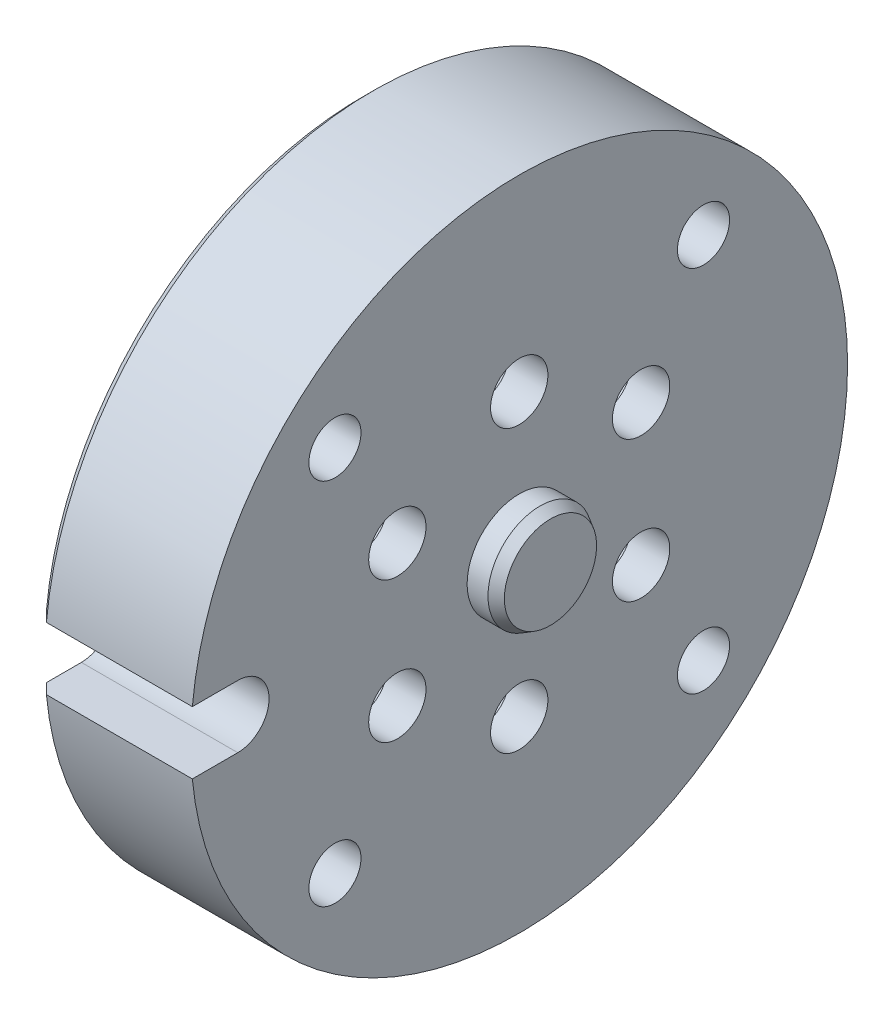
ISO-10303-21;
HEADER;
FILE_DESCRIPTION(('STEP AP214'),'2;1');
FILE_NAME('part.step','',(''),(''),'','','');
FILE_SCHEMA(('AUTOMOTIVE_DESIGN { 1 0 10303 214 1 1 1 1 }'));
ENDSEC;
DATA;
#1=APPLICATION_CONTEXT('core data for automotive mechanical design processes');
#2=APPLICATION_PROTOCOL_DEFINITION('international standard','automotive_design',2000,#1);
#3=PRODUCT_CONTEXT('',#1,'mechanical');
#4=PRODUCT('Part','Part','',(#3));
#5=PRODUCT_RELATED_PRODUCT_CATEGORY('part','',(#4));
#6=PRODUCT_DEFINITION_FORMATION('','',#4);
#7=PRODUCT_DEFINITION_CONTEXT('part definition',#1,'design');
#8=PRODUCT_DEFINITION('design','',#6,#7);
#9=PRODUCT_DEFINITION_SHAPE('','',#8);
#10=(LENGTH_UNIT() NAMED_UNIT(*) SI_UNIT(.MILLI.,.METRE.));
#11=(NAMED_UNIT(*) PLANE_ANGLE_UNIT() SI_UNIT($,.RADIAN.));
#12=(NAMED_UNIT(*) SI_UNIT($,.STERADIAN.) SOLID_ANGLE_UNIT());
#13=UNCERTAINTY_MEASURE_WITH_UNIT(LENGTH_MEASURE(1.E-05),#10,'distance_accuracy_value','');
#14=(GEOMETRIC_REPRESENTATION_CONTEXT(3) GLOBAL_UNCERTAINTY_ASSIGNED_CONTEXT((#13)) GLOBAL_UNIT_ASSIGNED_CONTEXT((#10,
#11,#12)) REPRESENTATION_CONTEXT('',''));
#15=CARTESIAN_POINT('',(0.,0.,0.));
#16=DIRECTION('',(0.,0.,1.));
#17=DIRECTION('',(1.,0.,0.));
#18=AXIS2_PLACEMENT_3D('',#15,#16,#17);
#19=CARTESIAN_POINT('',(0.,0.,0.));
#20=DIRECTION('',(-1.,0.,0.));
#21=DIRECTION('',(0.,0.,1.));
#22=AXIS2_PLACEMENT_3D('',#19,#20,#21);
#23=CYLINDRICAL_SURFACE('',#22,15.75);
#24=CARTESIAN_POINT('',(6.,0.,0.));
#25=DIRECTION('',(-1.,0.,0.));
#26=DIRECTION('',(0.,0.,1.));
#27=AXIS2_PLACEMENT_3D('',#24,#25,#26);
#28=CIRCLE('',#27,15.75);
#29=CARTESIAN_POINT('',(6.,15.0115740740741,-4.76604068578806));
#30=VERTEX_POINT('',#29);
#31=CARTESIAN_POINT('',(6.,11.6332993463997,-10.617384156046));
#32=VERTEX_POINT('',#31);
#33=EDGE_CURVE('E443',#30,#32,#28,.T.);
#34=ORIENTED_EDGE('',*,*,#33,.F.);
#35=DIRECTION('',(-1.,0.,0.));
#36=VECTOR('',#35,1.);
#37=CARTESIAN_POINT('',(5.65,15.0115740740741,-4.76604068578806));
#38=LINE('',#37,#36);
#39=CARTESIAN_POINT('',(1.,15.0115740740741,-4.76604068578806));
#40=VERTEX_POINT('',#39);
#41=EDGE_CURVE('E582',#30,#40,#38,.T.);
#42=ORIENTED_EDGE('',*,*,#41,.T.);
#43=CARTESIAN_POINT('',(1.,0.,0.));
#44=DIRECTION('',(1.,0.,0.));
#45=DIRECTION('',(0.,0.,-1.));
#46=AXIS2_PLACEMENT_3D('',#43,#44,#45);
#47=CIRCLE('',#46,15.75);
#48=CARTESIAN_POINT('',(1.,11.6332993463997,-10.617384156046));
#49=VERTEX_POINT('',#48);
#50=EDGE_CURVE('E467',#40,#49,#47,.F.);
#51=ORIENTED_EDGE('',*,*,#50,.T.);
#52=DIRECTION('',(-1.,0.,0.));
#53=VECTOR('',#52,1.);
#54=CARTESIAN_POINT('',(5.65,11.6332993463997,-10.617384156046));
#55=LINE('',#54,#53);
#56=EDGE_CURVE('E393',#49,#32,#55,.F.);
#57=ORIENTED_EDGE('',*,*,#56,.T.);
#58=EDGE_LOOP('',(#34,#42,#51,#57));
#59=FACE_BOUND('',#58,.T.);
#60=ADVANCED_FACE('F16',(#59),#23,.F.);
#61=CARTESIAN_POINT('',(0.,31.5,0.));
#62=DIRECTION('',(1.,0.,0.));
#63=DIRECTION('',(0.,0.,-1.));
#64=AXIS2_PLACEMENT_3D('',#61,#62,#63);
#65=PLANE('',#64);
#66=CARTESIAN_POINT('',(0.,0.,-25.));
#67=DIRECTION('',(-1.,0.,0.));
#68=DIRECTION('',(0.,0.,1.));
#69=AXIS2_PLACEMENT_3D('',#66,#67,#68);
#70=CIRCLE('',#69,3.);
#71=CARTESIAN_POINT('',(0.,0.,-22.));
#72=VERTEX_POINT('',#71);
#73=EDGE_CURVE('E413',#72,#72,#70,.T.);
#74=ORIENTED_EDGE('',*,*,#73,.F.);
#75=EDGE_LOOP('',(#74));
#76=FACE_BOUND('',#75,.T.);
#77=CARTESIAN_POINT('',(0.,17.6776695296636,-17.6776695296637));
#78=DIRECTION('',(-1.,0.,0.));
#79=DIRECTION('',(0.,0.,1.));
#80=AXIS2_PLACEMENT_3D('',#77,#78,#79);
#81=CIRCLE('',#80,2.5);
#82=CARTESIAN_POINT('',(0.,17.6776695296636,-15.1776695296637));
#83=VERTEX_POINT('',#82);
#84=EDGE_CURVE('E419',#83,#83,#81,.T.);
#85=ORIENTED_EDGE('',*,*,#84,.F.);
#86=EDGE_LOOP('',(#85));
#87=FACE_BOUND('',#86,.T.);
#88=CARTESIAN_POINT('',(0.,-17.6776695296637,-17.6776695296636));
#89=DIRECTION('',(-1.,0.,0.));
#90=DIRECTION('',(0.,0.,1.));
#91=AXIS2_PLACEMENT_3D('',#88,#89,#90);
#92=CIRCLE('',#91,2.5);
#93=CARTESIAN_POINT('',(0.,-17.6776695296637,-15.1776695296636));
#94=VERTEX_POINT('',#93);
#95=EDGE_CURVE('E425',#94,#94,#92,.T.);
#96=ORIENTED_EDGE('',*,*,#95,.F.);
#97=EDGE_LOOP('',(#96));
#98=FACE_BOUND('',#97,.T.);
#99=CARTESIAN_POINT('',(0.,-17.6776695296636,17.6776695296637));
#100=DIRECTION('',(-1.,0.,0.));
#101=DIRECTION('',(0.,0.,1.));
#102=AXIS2_PLACEMENT_3D('',#99,#100,#101);
#103=CIRCLE('',#102,2.5);
#104=CARTESIAN_POINT('',(0.,-17.6776695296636,20.1776695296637));
#105=VERTEX_POINT('',#104);
#106=EDGE_CURVE('E431',#105,#105,#103,.T.);
#107=ORIENTED_EDGE('',*,*,#106,.F.);
#108=EDGE_LOOP('',(#107));
#109=FACE_BOUND('',#108,.T.);
#110=CARTESIAN_POINT('',(0.,17.6776695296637,17.6776695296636));
#111=DIRECTION('',(-1.,0.,0.));
#112=DIRECTION('',(0.,0.,1.));
#113=AXIS2_PLACEMENT_3D('',#110,#111,#112);
#114=CIRCLE('',#113,2.5);
#115=CARTESIAN_POINT('',(0.,17.6776695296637,20.1776695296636));
#116=VERTEX_POINT('',#115);
#117=EDGE_CURVE('E437',#116,#116,#114,.T.);
#118=ORIENTED_EDGE('',*,*,#117,.F.);
#119=EDGE_LOOP('',(#118));
#120=FACE_BOUND('',#119,.T.);
#121=DIRECTION('',(0.,0.,-1.));
#122=VECTOR('',#121,1.);
#123=CARTESIAN_POINT('',(0.,3.,27.));
#124=LINE('',#123,#122);
#125=CARTESIAN_POINT('',(0.,3.,30.3521004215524));
#126=VERTEX_POINT('',#125);
#127=CARTESIAN_POINT('',(0.,3.,27.));
#128=VERTEX_POINT('',#127);
#129=EDGE_CURVE('E402',#126,#128,#124,.T.);
#130=ORIENTED_EDGE('',*,*,#129,.F.);
#131=CARTESIAN_POINT('',(0.,0.,0.));
#132=DIRECTION('',(1.,0.,0.));
#133=DIRECTION('',(0.,0.,-1.));
#134=AXIS2_PLACEMENT_3D('',#131,#132,#133);
#135=CIRCLE('',#134,30.5);
#136=CARTESIAN_POINT('',(0.,-3.,30.3521004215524));
#137=VERTEX_POINT('',#136);
#138=EDGE_CURVE('E188',#126,#137,#135,.F.);
#139=ORIENTED_EDGE('',*,*,#138,.T.);
#140=DIRECTION('',(0.,0.,1.));
#141=VECTOR('',#140,1.);
#142=CARTESIAN_POINT('',(0.,-3.,27.));
#143=LINE('',#142,#141);
#144=CARTESIAN_POINT('',(0.,-3.,27.));
#145=VERTEX_POINT('',#144);
#146=EDGE_CURVE('E400',#145,#137,#143,.T.);
#147=ORIENTED_EDGE('',*,*,#146,.F.);
#148=CARTESIAN_POINT('',(0.,0.,27.));
#149=DIRECTION('',(-1.,0.,0.));
#150=DIRECTION('',(0.,0.,1.));
#151=AXIS2_PLACEMENT_3D('',#148,#149,#150);
#152=CIRCLE('',#151,3.);
#153=EDGE_CURVE('E397',#128,#145,#152,.T.);
#154=ORIENTED_EDGE('',*,*,#153,.F.);
#155=EDGE_LOOP('',(#130,#139,#147,#154));
#156=FACE_BOUND('',#155,.T.);
#157=CARTESIAN_POINT('',(0.,13.5,0.));
#158=DIRECTION('',(-1.,0.,0.));
#159=DIRECTION('',(0.,0.,1.));
#160=AXIS2_PLACEMENT_3D('',#157,#158,#159);
#161=CIRCLE('',#160,5.);
#162=CARTESIAN_POINT('',(0.,16.2152777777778,4.19848384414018));
#163=VERTEX_POINT('',#162);
#164=CARTESIAN_POINT('',(0.,16.2152777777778,-4.19848384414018));
#165=VERTEX_POINT('',#164);
#166=EDGE_CURVE('E180',#163,#165,#161,.T.);
#167=ORIENTED_EDGE('',*,*,#166,.F.);
#168=CARTESIAN_POINT('',(0.,0.,0.));
#169=DIRECTION('',(1.,0.,0.));
#170=DIRECTION('',(0.,0.,-1.));
#171=AXIS2_PLACEMENT_3D('',#168,#169,#170);
#172=CIRCLE('',#171,16.75);
#173=CARTESIAN_POINT('',(0.,11.7436325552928,11.9436005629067));
#174=VERTEX_POINT('',#173);
#175=EDGE_CURVE('E195',#163,#174,#172,.T.);
#176=ORIENTED_EDGE('',*,*,#175,.T.);
#177=CARTESIAN_POINT('',(0.,6.75,11.6913429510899));
#178=DIRECTION('',(-1.,0.,0.));
#179=DIRECTION('',(0.,0.,1.));
#180=AXIS2_PLACEMENT_3D('',#177,#178,#179);
#181=CIRCLE('',#180,5.);
#182=CARTESIAN_POINT('',(0.,4.47164522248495,16.1420844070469));
#183=VERTEX_POINT('',#182);
#184=EDGE_CURVE('E264',#183,#174,#181,.T.);
#185=ORIENTED_EDGE('',*,*,#184,.F.);
#186=CARTESIAN_POINT('',(0.,-4.47164522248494,16.1420844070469));
#187=VERTEX_POINT('',#186);
#188=EDGE_CURVE('E205',#183,#187,#172,.T.);
#189=ORIENTED_EDGE('',*,*,#188,.T.);
#190=CARTESIAN_POINT('',(0.,-6.75,11.6913429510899));
#191=DIRECTION('',(-1.,0.,0.));
#192=DIRECTION('',(0.,0.,1.));
#193=AXIS2_PLACEMENT_3D('',#190,#191,#192);
#194=CIRCLE('',#193,5.);
#195=CARTESIAN_POINT('',(0.,-11.7436325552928,11.9436005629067));
#196=VERTEX_POINT('',#195);
#197=EDGE_CURVE('E306',#196,#187,#194,.T.);
#198=ORIENTED_EDGE('',*,*,#197,.F.);
#199=CARTESIAN_POINT('',(0.,-16.2152777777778,4.19848384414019));
#200=VERTEX_POINT('',#199);
#201=EDGE_CURVE('E209',#196,#200,#172,.T.);
#202=ORIENTED_EDGE('',*,*,#201,.T.);
#203=CARTESIAN_POINT('',(0.,-13.5,0.));
#204=DIRECTION('',(-1.,0.,0.));
#205=DIRECTION('',(0.,0.,1.));
#206=AXIS2_PLACEMENT_3D('',#203,#204,#205);
#207=CIRCLE('',#206,5.);
#208=CARTESIAN_POINT('',(0.,-16.2152777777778,-4.19848384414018));
#209=VERTEX_POINT('',#208);
#210=EDGE_CURVE('E340',#209,#200,#207,.T.);
#211=ORIENTED_EDGE('',*,*,#210,.F.);
#212=CARTESIAN_POINT('',(0.,-11.7436325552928,-11.9436005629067));
#213=VERTEX_POINT('',#212);
#214=EDGE_CURVE('E480',#209,#213,#172,.T.);
#215=ORIENTED_EDGE('',*,*,#214,.T.);
#216=CARTESIAN_POINT('',(0.,-6.75,-11.6913429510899));
#217=DIRECTION('',(-1.,0.,0.));
#218=DIRECTION('',(0.,0.,1.));
#219=AXIS2_PLACEMENT_3D('',#216,#217,#218);
#220=CIRCLE('',#219,5.);
#221=CARTESIAN_POINT('',(0.,-4.47164522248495,-16.1420844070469));
#222=VERTEX_POINT('',#221);
#223=EDGE_CURVE('E359',#222,#213,#220,.T.);
#224=ORIENTED_EDGE('',*,*,#223,.F.);
#225=CARTESIAN_POINT('',(0.,4.47164522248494,-16.1420844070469));
#226=VERTEX_POINT('',#225);
#227=EDGE_CURVE('E208',#222,#226,#172,.T.);
#228=ORIENTED_EDGE('',*,*,#227,.T.);
#229=CARTESIAN_POINT('',(0.,6.75,-11.6913429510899));
#230=DIRECTION('',(-1.,0.,0.));
#231=DIRECTION('',(0.,0.,1.));
#232=AXIS2_PLACEMENT_3D('',#229,#230,#231);
#233=CIRCLE('',#232,5.);
#234=CARTESIAN_POINT('',(0.,11.7436325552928,-11.9436005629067));
#235=VERTEX_POINT('',#234);
#236=EDGE_CURVE('E378',#235,#226,#233,.T.);
#237=ORIENTED_EDGE('',*,*,#236,.F.);
#238=EDGE_CURVE('E199',#235,#165,#172,.T.);
#239=ORIENTED_EDGE('',*,*,#238,.T.);
#240=EDGE_LOOP('',(#167,#176,#185,#189,#198,#202,#211,#215,#224,#228,#237,#239));
#241=FACE_BOUND('',#240,.T.);
#242=ADVANCED_FACE('F193',(#76,#87,#98,#109,#120,#156,#241),#65,.F.);
#243=CARTESIAN_POINT('',(1.,0.,0.));
#244=DIRECTION('',(-1.,0.,0.));
#245=DIRECTION('',(0.,0.,1.));
#246=AXIS2_PLACEMENT_3D('',#243,#244,#245);
#247=CONICAL_SURFACE('',#246,15.75,0.785398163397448);
#248=CARTESIAN_POINT('',(1.0002,15.0113407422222,4.76611468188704));
#249=CARTESIAN_POINT('',(0.912059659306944,15.1141669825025,4.73350697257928));
#250=CARTESIAN_POINT('',(0.824896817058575,15.216721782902,4.69732536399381));
#251=CARTESIAN_POINT('',(0.653084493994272,15.4204945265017,4.61775153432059));
#252=CARTESIAN_POINT('',(0.568427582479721,15.521715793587,4.57438383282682));
#253=CARTESIAN_POINT('',(0.401585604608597,15.7227294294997,4.48015562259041));
#254=CARTESIAN_POINT('',(0.319400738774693,15.8225216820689,4.42929450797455));
#255=CARTESIAN_POINT('',(0.157550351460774,16.0204738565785,4.31972797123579));
#256=CARTESIAN_POINT('',(0.0778942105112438,16.1186271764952,4.26099679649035));
#257=CARTESIAN_POINT('',(-0.000199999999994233,16.2155259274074,4.19832334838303));
#258=B_SPLINE_CURVE_WITH_KNOTS('',3,(#248,#249,#250,#251,#252,#253,#254,#255,#256,#257),
.UNSPECIFIED.,.F.,.F.,(4,2,2,2,4),(0.,0.417883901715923,0.834370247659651,1.25089028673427,
1.66880816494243),.UNSPECIFIED.);
#259=CARTESIAN_POINT('',(1.,15.0115740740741,4.76604068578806));
#260=VERTEX_POINT('',#259);
#261=EDGE_CURVE('E176',#260,#163,#258,.T.);
#262=ORIENTED_EDGE('',*,*,#261,.F.);
#263=CARTESIAN_POINT('',(1.,11.6332993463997,10.617384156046));
#264=VERTEX_POINT('',#263);
#265=EDGE_CURVE('E470',#264,#260,#47,.F.);
#266=ORIENTED_EDGE('',*,*,#265,.F.);
#267=CARTESIAN_POINT('',(-0.000199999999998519,11.7436176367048,11.9438957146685));
#268=CARTESIAN_POINT('',(0.0778942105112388,11.7494450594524,11.82864221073));
#269=CARTESIAN_POINT('',(0.157550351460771,11.7512310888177,11.7142733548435));
#270=CARTESIAN_POINT('',(0.319400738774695,11.7471424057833,11.4880584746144));
#271=CARTESIAN_POINT('',(0.401585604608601,11.7412932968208,11.3762052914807));
#272=CARTESIAN_POINT('',(0.56842758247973,11.7223905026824,11.1550082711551));
#273=CARTESIAN_POINT('',(0.653084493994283,11.7093374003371,11.0456642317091));
#274=CARTESIAN_POINT('',(0.824896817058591,11.6763639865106,10.8294049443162));
#275=CARTESIAN_POINT('',(0.912059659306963,11.6564207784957,10.7224990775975));
#276=CARTESIAN_POINT('',(1.00020000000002,11.6332467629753,10.6171450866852));
#277=B_SPLINE_CURVE_WITH_KNOTS('',3,(#267,#268,#269,#270,#271,#272,#273,#274,#275,#276),
.UNSPECIFIED.,.F.,.F.,(4,2,2,2,4),(0.,0.417917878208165,0.834437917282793,1.25092426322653,
1.66880816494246),.UNSPECIFIED.);
#278=EDGE_CURVE('E204',#174,#264,#277,.T.);
#279=ORIENTED_EDGE('',*,*,#278,.F.);
#280=ORIENTED_EDGE('',*,*,#175,.F.);
#281=EDGE_LOOP('',(#262,#266,#279,#280));
#282=FACE_BOUND('',#281,.T.);
#283=ADVANCED_FACE('F203',(#282),#247,.F.);
#284=ORIENTED_EDGE('',*,*,#265,.T.);
#285=DIRECTION('',(-1.,0.,0.));
#286=VECTOR('',#285,1.);
#287=CARTESIAN_POINT('',(5.65,15.0115740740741,4.76604068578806));
#288=LINE('',#287,#286);
#289=CARTESIAN_POINT('',(6.,15.0115740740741,4.76604068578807));
#290=VERTEX_POINT('',#289);
#291=EDGE_CURVE('E183',#260,#290,#288,.F.);
#292=ORIENTED_EDGE('',*,*,#291,.T.);
#293=CARTESIAN_POINT('',(6.,11.6332993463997,10.617384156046));
#294=VERTEX_POINT('',#293);
#295=EDGE_CURVE('E512',#294,#290,#28,.T.);
#296=ORIENTED_EDGE('',*,*,#295,.F.);
#297=DIRECTION('',(-1.,0.,0.));
#298=VECTOR('',#297,1.);
#299=CARTESIAN_POINT('',(5.65,11.6332993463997,10.617384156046));
#300=LINE('',#299,#298);
#301=EDGE_CURVE('E321',#294,#264,#300,.T.);
#302=ORIENTED_EDGE('',*,*,#301,.T.);
#303=EDGE_LOOP('',(#284,#292,#296,#302));
#304=FACE_BOUND('',#303,.T.);
#305=ADVANCED_FACE('F510',(#304),#23,.F.);
#306=CARTESIAN_POINT('',(1.0002,3.37809397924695,15.3832597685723));
#307=CARTESIAN_POINT('',(0.912059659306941,3.45774620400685,15.4560060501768));
#308=CARTESIAN_POINT('',(0.824896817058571,3.54035779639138,15.5267303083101));
#309=CARTESIAN_POINT('',(0.653084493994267,3.71115712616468,15.6634157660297));
#310=CARTESIAN_POINT('',(0.568427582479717,3.79932529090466,15.7293921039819));
#311=CARTESIAN_POINT('',(0.401585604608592,3.98143613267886,15.8563609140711));
#312=CARTESIAN_POINT('',(0.319400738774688,4.07537927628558,15.917352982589));
#313=CARTESIAN_POINT('',(0.157550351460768,4.26924276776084,16.0340013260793));
#314=CARTESIAN_POINT('',(0.0778942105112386,4.36918211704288,16.0896390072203));
#315=CARTESIAN_POINT('',(-0.000199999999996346,4.47190829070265,16.1422190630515));
#316=B_SPLINE_CURVE_WITH_KNOTS('',3,(#306,#307,#308,#309,#310,#311,#312,#313,#314,#315),
.UNSPECIFIED.,.F.,.F.,(4,2,2,2,4),(0.,0.417883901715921,0.834370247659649,1.25089028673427,
1.66880816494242),.UNSPECIFIED.);
#317=CARTESIAN_POINT('',(1.,3.37827472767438,15.383424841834));
#318=VERTEX_POINT('',#317);
#319=EDGE_CURVE('E300',#318,#183,#316,.T.);
#320=ORIENTED_EDGE('',*,*,#319,.F.);
#321=CARTESIAN_POINT('',(1.,-3.37827472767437,15.383424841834));
#322=VERTEX_POINT('',#321);
#323=EDGE_CURVE('E475',#322,#318,#47,.F.);
#324=ORIENTED_EDGE('',*,*,#323,.F.);
#325=CARTESIAN_POINT('',(-0.000199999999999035,-4.47190829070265,16.1422190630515));
#326=CARTESIAN_POINT('',(0.0778942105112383,-4.36918211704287,16.0896390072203));
#327=CARTESIAN_POINT('',(0.157550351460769,-4.26924276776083,16.0340013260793));
#328=CARTESIAN_POINT('',(0.319400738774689,-4.07537927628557,15.917352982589));
#329=CARTESIAN_POINT('',(0.401585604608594,-3.98143613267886,15.8563609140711));
#330=CARTESIAN_POINT('',(0.568427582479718,-3.79932529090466,15.7293921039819));
#331=CARTESIAN_POINT('',(0.653084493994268,-3.71115712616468,15.6634157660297));
#332=CARTESIAN_POINT('',(0.824896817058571,-3.54035779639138,15.5267303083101));
#333=CARTESIAN_POINT('',(0.912059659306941,-3.45774620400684,15.4560060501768));
#334=CARTESIAN_POINT('',(1.0002,-3.37809397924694,15.3832597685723));
#335=B_SPLINE_CURVE_WITH_KNOTS('',3,(#325,#326,#327,#328,#329,#330,#331,#332,#333,#334),
.UNSPECIFIED.,.F.,.F.,(4,2,2,2,4),(0.,0.417917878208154,0.834437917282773,1.2509242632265,
1.66880816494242),.UNSPECIFIED.);
#336=EDGE_CURVE('E495',#187,#322,#335,.T.);
#337=ORIENTED_EDGE('',*,*,#336,.F.);
#338=ORIENTED_EDGE('',*,*,#188,.F.);
#339=EDGE_LOOP('',(#320,#324,#337,#338));
#340=FACE_BOUND('',#339,.T.);
#341=ADVANCED_FACE('F493',(#340),#247,.F.);
#342=ORIENTED_EDGE('',*,*,#323,.T.);
#343=DIRECTION('',(-1.,0.,0.));
#344=VECTOR('',#343,1.);
#345=CARTESIAN_POINT('',(5.65,3.37827472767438,15.383424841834));
#346=LINE('',#345,#344);
#347=CARTESIAN_POINT('',(6.,3.37827472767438,15.383424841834));
#348=VERTEX_POINT('',#347);
#349=EDGE_CURVE('E307',#318,#348,#346,.F.);
#350=ORIENTED_EDGE('',*,*,#349,.T.);
#351=CARTESIAN_POINT('',(6.,-3.37827472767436,15.383424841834));
#352=VERTEX_POINT('',#351);
#353=EDGE_CURVE('E516',#352,#348,#28,.T.);
#354=ORIENTED_EDGE('',*,*,#353,.F.);
#355=DIRECTION('',(-1.,0.,0.));
#356=VECTOR('',#355,1.);
#357=CARTESIAN_POINT('',(5.65,-3.37827472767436,15.383424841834));
#358=LINE('',#357,#356);
#359=EDGE_CURVE('E330',#352,#322,#358,.T.);
#360=ORIENTED_EDGE('',*,*,#359,.T.);
#361=EDGE_LOOP('',(#342,#350,#354,#360));
#362=FACE_BOUND('',#361,.T.);
#363=ADVANCED_FACE('F489',(#362),#23,.F.);
#364=CARTESIAN_POINT('',(1.00020000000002,-11.6332467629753,10.6171450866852));
#365=CARTESIAN_POINT('',(0.912059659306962,-11.6564207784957,10.7224990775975));
#366=CARTESIAN_POINT('',(0.82489681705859,-11.6763639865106,10.8294049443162));
#367=CARTESIAN_POINT('',(0.653084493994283,-11.7093374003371,11.0456642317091));
#368=CARTESIAN_POINT('',(0.56842758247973,-11.7223905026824,11.1550082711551));
#369=CARTESIAN_POINT('',(0.401585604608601,-11.7412932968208,11.3762052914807));
#370=CARTESIAN_POINT('',(0.319400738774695,-11.7471424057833,11.4880584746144));
#371=CARTESIAN_POINT('',(0.157550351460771,-11.7512310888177,11.7142733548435));
#372=CARTESIAN_POINT('',(0.0778942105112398,-11.7494450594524,11.82864221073));
#373=CARTESIAN_POINT('',(-0.000199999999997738,-11.7436176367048,11.9438957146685));
#374=B_SPLINE_CURVE_WITH_KNOTS('',3,(#364,#365,#366,#367,#368,#369,#370,#371,#372,#373),
.UNSPECIFIED.,.F.,.F.,(4,2,2,2,4),(0.,0.41788390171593,0.834370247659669,1.2508902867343,
1.66880816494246),.UNSPECIFIED.);
#375=CARTESIAN_POINT('',(1.,-11.6332993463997,10.617384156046));
#376=VERTEX_POINT('',#375);
#377=EDGE_CURVE('E924',#376,#196,#374,.T.);
#378=ORIENTED_EDGE('',*,*,#377,.F.);
#379=CARTESIAN_POINT('',(1.,-15.0115740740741,4.76604068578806));
#380=VERTEX_POINT('',#379);
#381=EDGE_CURVE('E482',#380,#376,#47,.F.);
#382=ORIENTED_EDGE('',*,*,#381,.F.);
#383=CARTESIAN_POINT('',(-0.000199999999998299,-16.2155259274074,4.19832334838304));
#384=CARTESIAN_POINT('',(0.0778942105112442,-16.1186271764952,4.26099679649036));
#385=CARTESIAN_POINT('',(0.157550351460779,-16.0204738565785,4.3197279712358));
#386=CARTESIAN_POINT('',(0.319400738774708,-15.8225216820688,4.42929450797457));
#387=CARTESIAN_POINT('',(0.401585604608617,-15.7227294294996,4.48015562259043));
#388=CARTESIAN_POINT('',(0.568427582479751,-15.521715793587,4.57438383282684));
#389=CARTESIAN_POINT('',(0.653084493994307,-15.4204945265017,4.61775153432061));
#390=CARTESIAN_POINT('',(0.824896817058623,-15.2167217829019,4.69732536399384));
#391=CARTESIAN_POINT('',(0.912059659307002,-15.1141669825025,4.7335069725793));
#392=CARTESIAN_POINT('',(1.00020000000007,-15.0113407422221,4.76611468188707));
#393=B_SPLINE_CURVE_WITH_KNOTS('',3,(#383,#384,#385,#386,#387,#388,#389,#390,#391,#392),
.UNSPECIFIED.,.F.,.F.,(4,2,2,2,4),(0.,0.417917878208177,0.83443791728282,1.25092426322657,
1.66880816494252),.UNSPECIFIED.);
#394=EDGE_CURVE('E895',#200,#380,#393,.T.);
#395=ORIENTED_EDGE('',*,*,#394,.F.);
#396=ORIENTED_EDGE('',*,*,#201,.F.);
#397=EDGE_LOOP('',(#378,#382,#395,#396));
#398=FACE_BOUND('',#397,.T.);
#399=ADVANCED_FACE('F556',(#398),#247,.F.);
#400=ORIENTED_EDGE('',*,*,#381,.T.);
#401=DIRECTION('',(-1.,0.,0.));
#402=VECTOR('',#401,1.);
#403=CARTESIAN_POINT('',(5.65,-11.6332993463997,10.617384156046));
#404=LINE('',#403,#402);
#405=CARTESIAN_POINT('',(6.,-11.6332993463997,10.617384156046));
#406=VERTEX_POINT('',#405);
#407=EDGE_CURVE('E336',#376,#406,#404,.F.);
#408=ORIENTED_EDGE('',*,*,#407,.T.);
#409=CARTESIAN_POINT('',(6.,-15.0115740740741,4.76604068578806));
#410=VERTEX_POINT('',#409);
#411=EDGE_CURVE('E518',#410,#406,#28,.T.);
#412=ORIENTED_EDGE('',*,*,#411,.F.);
#413=DIRECTION('',(-1.,0.,0.));
#414=VECTOR('',#413,1.);
#415=CARTESIAN_POINT('',(5.65,-15.0115740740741,4.76604068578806));
#416=LINE('',#415,#414);
#417=EDGE_CURVE('E349',#410,#380,#416,.T.);
#418=ORIENTED_EDGE('',*,*,#417,.T.);
#419=EDGE_LOOP('',(#400,#408,#412,#418));
#420=FACE_BOUND('',#419,.T.);
#421=ADVANCED_FACE('F550',(#420),#23,.F.);
#422=CARTESIAN_POINT('',(1.00020000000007,-15.0113407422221,-4.76611468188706));
#423=CARTESIAN_POINT('',(0.912059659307,-15.1141669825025,-4.73350697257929));
#424=CARTESIAN_POINT('',(0.824896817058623,-15.2167217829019,-4.69732536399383));
#425=CARTESIAN_POINT('',(0.653084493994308,-15.4204945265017,-4.6177515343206));
#426=CARTESIAN_POINT('',(0.568427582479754,-15.521715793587,-4.57438383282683));
#427=CARTESIAN_POINT('',(0.40158560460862,-15.7227294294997,-4.48015562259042));
#428=CARTESIAN_POINT('',(0.31940073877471,-15.8225216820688,-4.42929450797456));
#429=CARTESIAN_POINT('',(0.157550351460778,-16.0204738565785,-4.31972797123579));
#430=CARTESIAN_POINT('',(0.0778942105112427,-16.1186271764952,-4.26099679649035));
#431=CARTESIAN_POINT('',(-0.000199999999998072,-16.2155259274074,-4.19832334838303));
#432=B_SPLINE_CURVE_WITH_KNOTS('',3,(#422,#423,#424,#425,#426,#427,#428,#429,#430,#431),
.UNSPECIFIED.,.F.,.F.,(4,2,2,2,4),(0.,0.417883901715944,0.834370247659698,1.25089028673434,
1.66880816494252),.UNSPECIFIED.);
#433=CARTESIAN_POINT('',(1.,-15.0115740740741,-4.76604068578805));
#434=VERTEX_POINT('',#433);
#435=EDGE_CURVE('E900',#434,#209,#432,.T.);
#436=ORIENTED_EDGE('',*,*,#435,.F.);
#437=CARTESIAN_POINT('',(1.,-11.6332993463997,-10.617384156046));
#438=VERTEX_POINT('',#437);
#439=EDGE_CURVE('E477',#438,#434,#47,.F.);
#440=ORIENTED_EDGE('',*,*,#439,.F.);
#441=CARTESIAN_POINT('',(-0.000199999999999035,-11.7436176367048,-11.9438957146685));
#442=CARTESIAN_POINT('',(0.0778942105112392,-11.7494450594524,-11.82864221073));
#443=CARTESIAN_POINT('',(0.157550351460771,-11.7512310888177,-11.7142733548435));
#444=CARTESIAN_POINT('',(0.319400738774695,-11.7471424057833,-11.4880584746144));
#445=CARTESIAN_POINT('',(0.401585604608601,-11.7412932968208,-11.3762052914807));
#446=CARTESIAN_POINT('',(0.56842758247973,-11.7223905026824,-11.1550082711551));
#447=CARTESIAN_POINT('',(0.653084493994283,-11.7093374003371,-11.0456642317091));
#448=CARTESIAN_POINT('',(0.824896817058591,-11.6763639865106,-10.8294049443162));
#449=CARTESIAN_POINT('',(0.912059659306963,-11.6564207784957,-10.7224990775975));
#450=CARTESIAN_POINT('',(1.00020000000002,-11.6332467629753,-10.6171450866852));
#451=B_SPLINE_CURVE_WITH_KNOTS('',3,(#441,#442,#443,#444,#445,#446,#447,#448,#449,#450),
.UNSPECIFIED.,.F.,.F.,(4,2,2,2,4),(0.,0.417917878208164,0.834437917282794,1.25092426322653,
1.66880816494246),.UNSPECIFIED.);
#452=EDGE_CURVE('E909',#213,#438,#451,.T.);
#453=ORIENTED_EDGE('',*,*,#452,.F.);
#454=ORIENTED_EDGE('',*,*,#214,.F.);
#455=EDGE_LOOP('',(#436,#440,#453,#454));
#456=FACE_BOUND('',#455,.T.);
#457=ADVANCED_FACE('F548',(#456),#247,.F.);
#458=ORIENTED_EDGE('',*,*,#439,.T.);
#459=DIRECTION('',(-1.,0.,0.));
#460=VECTOR('',#459,1.);
#461=CARTESIAN_POINT('',(5.65,-15.0115740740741,-4.76604068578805));
#462=LINE('',#461,#460);
#463=CARTESIAN_POINT('',(6.,-15.0115740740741,-4.76604068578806));
#464=VERTEX_POINT('',#463);
#465=EDGE_CURVE('E355',#434,#464,#462,.F.);
#466=ORIENTED_EDGE('',*,*,#465,.T.);
#467=CARTESIAN_POINT('',(6.,-11.6332993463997,-10.617384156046));
#468=VERTEX_POINT('',#467);
#469=EDGE_CURVE('E448',#468,#464,#28,.T.);
#470=ORIENTED_EDGE('',*,*,#469,.F.);
#471=DIRECTION('',(-1.,0.,0.));
#472=VECTOR('',#471,1.);
#473=CARTESIAN_POINT('',(5.65,-11.6332993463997,-10.617384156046));
#474=LINE('',#473,#472);
#475=EDGE_CURVE('E368',#468,#438,#474,.T.);
#476=ORIENTED_EDGE('',*,*,#475,.T.);
#477=EDGE_LOOP('',(#458,#466,#470,#476));
#478=FACE_BOUND('',#477,.T.);
#479=ADVANCED_FACE('F539',(#478),#23,.F.);
#480=CARTESIAN_POINT('',(1.0002,-3.37809397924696,-15.3832597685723));
#481=CARTESIAN_POINT('',(0.912059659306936,-3.45774620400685,-15.4560060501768));
#482=CARTESIAN_POINT('',(0.824896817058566,-3.54035779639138,-15.5267303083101));
#483=CARTESIAN_POINT('',(0.653084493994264,-3.71115712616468,-15.6634157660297));
#484=CARTESIAN_POINT('',(0.568427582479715,-3.79932529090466,-15.7293921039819));
#485=CARTESIAN_POINT('',(0.401585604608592,-3.98143613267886,-15.8563609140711));
#486=CARTESIAN_POINT('',(0.319400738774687,-4.07537927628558,-15.917352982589));
#487=CARTESIAN_POINT('',(0.157550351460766,-4.26924276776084,-16.0340013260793));
#488=CARTESIAN_POINT('',(0.0778942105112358,-4.36918211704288,-16.0896390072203));
#489=CARTESIAN_POINT('',(-0.000199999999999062,-4.47190829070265,-16.1422190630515));
#490=B_SPLINE_CURVE_WITH_KNOTS('',3,(#480,#481,#482,#483,#484,#485,#486,#487,#488,#489),
.UNSPECIFIED.,.F.,.F.,(4,2,2,2,4),(0.,0.417883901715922,0.834370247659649,1.25089028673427,
1.66880816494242),.UNSPECIFIED.);
#491=CARTESIAN_POINT('',(1.,-3.37827472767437,-15.383424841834));
#492=VERTEX_POINT('',#491);
#493=EDGE_CURVE('E890',#492,#222,#490,.T.);
#494=ORIENTED_EDGE('',*,*,#493,.F.);
#495=CARTESIAN_POINT('',(1.,3.37827472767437,-15.383424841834));
#496=VERTEX_POINT('',#495);
#497=EDGE_CURVE('E212',#496,#492,#47,.F.);
#498=ORIENTED_EDGE('',*,*,#497,.F.);
#499=CARTESIAN_POINT('',(-0.000199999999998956,4.47190829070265,-16.1422190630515));
#500=CARTESIAN_POINT('',(0.0778942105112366,4.36918211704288,-16.0896390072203));
#501=CARTESIAN_POINT('',(0.157550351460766,4.26924276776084,-16.0340013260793));
#502=CARTESIAN_POINT('',(0.319400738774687,4.07537927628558,-15.917352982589));
#503=CARTESIAN_POINT('',(0.401585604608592,3.98143613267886,-15.8563609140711));
#504=CARTESIAN_POINT('',(0.568427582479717,3.79932529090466,-15.7293921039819));
#505=CARTESIAN_POINT('',(0.653084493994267,3.71115712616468,-15.6634157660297));
#506=CARTESIAN_POINT('',(0.824896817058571,3.54035779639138,-15.5267303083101));
#507=CARTESIAN_POINT('',(0.91205965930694,3.45774620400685,-15.4560060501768));
#508=CARTESIAN_POINT('',(1.0002,3.37809397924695,-15.3832597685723));
#509=B_SPLINE_CURVE_WITH_KNOTS('',3,(#499,#500,#501,#502,#503,#504,#505,#506,#507,#508),
.UNSPECIFIED.,.F.,.F.,(4,2,2,2,4),(0.,0.417917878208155,0.834437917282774,1.2509242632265,
1.66880816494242),.UNSPECIFIED.);
#510=EDGE_CURVE('E207',#226,#496,#509,.T.);
#511=ORIENTED_EDGE('',*,*,#510,.F.);
#512=ORIENTED_EDGE('',*,*,#227,.F.);
#513=EDGE_LOOP('',(#494,#498,#511,#512));
#514=FACE_BOUND('',#513,.T.);
#515=ADVANCED_FACE('F538',(#514),#247,.F.);
#516=ORIENTED_EDGE('',*,*,#497,.T.);
#517=DIRECTION('',(-1.,0.,0.));
#518=VECTOR('',#517,1.);
#519=CARTESIAN_POINT('',(5.65,-3.37827472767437,-15.383424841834));
#520=LINE('',#519,#518);
#521=CARTESIAN_POINT('',(6.,-3.37827472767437,-15.383424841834));
#522=VERTEX_POINT('',#521);
#523=EDGE_CURVE('E374',#492,#522,#520,.F.);
#524=ORIENTED_EDGE('',*,*,#523,.T.);
#525=CARTESIAN_POINT('',(6.,3.37827472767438,-15.383424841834));
#526=VERTEX_POINT('',#525);
#527=EDGE_CURVE('E444',#526,#522,#28,.T.);
#528=ORIENTED_EDGE('',*,*,#527,.F.);
#529=DIRECTION('',(-1.,0.,0.));
#530=VECTOR('',#529,1.);
#531=CARTESIAN_POINT('',(5.65,3.37827472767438,-15.383424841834));
#532=LINE('',#531,#530);
#533=EDGE_CURVE('E387',#526,#496,#532,.T.);
#534=ORIENTED_EDGE('',*,*,#533,.T.);
#535=EDGE_LOOP('',(#516,#524,#528,#534));
#536=FACE_BOUND('',#535,.T.);
#537=ADVANCED_FACE('F527',(#536),#23,.F.);
#538=CARTESIAN_POINT('',(0.,0.,0.));
#539=DIRECTION('',(-1.,0.,0.));
#540=DIRECTION('',(0.,0.,1.));
#541=AXIS2_PLACEMENT_3D('',#538,#539,#540);
#542=CYLINDRICAL_SURFACE('',#541,31.5);
#543=DIRECTION('',(-1.,0.,0.));
#544=VECTOR('',#543,1.);
#545=CARTESIAN_POINT('',(0.,-3.,31.3568174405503));
#546=LINE('',#545,#544);
#547=CARTESIAN_POINT('',(15.,-3.,31.3568174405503));
#548=VERTEX_POINT('',#547);
#549=CARTESIAN_POINT('',(1.,-3.,31.3568174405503));
#550=VERTEX_POINT('',#549);
#551=EDGE_CURVE('E408',#548,#550,#546,.T.);
#552=ORIENTED_EDGE('',*,*,#551,.T.);
#553=CARTESIAN_POINT('',(1.,0.,0.));
#554=DIRECTION('',(1.,0.,0.));
#555=DIRECTION('',(0.,0.,-1.));
#556=AXIS2_PLACEMENT_3D('',#553,#554,#555);
#557=CIRCLE('',#556,31.5);
#558=CARTESIAN_POINT('',(1.00000000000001,3.,31.3568174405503));
#559=VERTEX_POINT('',#558);
#560=EDGE_CURVE('E29',#550,#559,#557,.T.);
#561=ORIENTED_EDGE('',*,*,#560,.T.);
#562=DIRECTION('',(-1.,0.,0.));
#563=VECTOR('',#562,1.);
#564=CARTESIAN_POINT('',(0.,3.,31.3568174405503));
#565=LINE('',#564,#563);
#566=CARTESIAN_POINT('',(15.,3.,31.3568174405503));
#567=VERTEX_POINT('',#566);
#568=EDGE_CURVE('E411',#559,#567,#565,.F.);
#569=ORIENTED_EDGE('',*,*,#568,.T.);
#570=CARTESIAN_POINT('',(15.,0.,0.));
#571=DIRECTION('',(-1.,0.,0.));
#572=DIRECTION('',(0.,0.,1.));
#573=AXIS2_PLACEMENT_3D('',#570,#571,#572);
#574=CIRCLE('',#573,31.5);
#575=EDGE_CURVE('E451',#567,#548,#574,.T.);
#576=ORIENTED_EDGE('',*,*,#575,.T.);
#577=EDGE_LOOP('',(#552,#561,#569,#576));
#578=FACE_BOUND('',#577,.T.);
#579=ADVANCED_FACE('F537',(#578),#542,.T.);
#580=CARTESIAN_POINT('',(15.,5.,0.));
#581=DIRECTION('',(-1.,0.,0.));
#582=DIRECTION('',(0.,0.,1.));
#583=AXIS2_PLACEMENT_3D('',#580,#581,#582);
#584=PLANE('',#583);
#585=CARTESIAN_POINT('',(15.,13.5,0.));
#586=DIRECTION('',(-1.,0.,0.));
#587=DIRECTION('',(0.,0.,1.));
#588=AXIS2_PLACEMENT_3D('',#585,#586,#587);
#589=CIRCLE('',#588,2.75);
#590=CARTESIAN_POINT('',(15.,13.5,2.75));
#591=VERTEX_POINT('',#590);
#592=EDGE_CURVE('E262',#591,#591,#589,.T.);
#593=ORIENTED_EDGE('',*,*,#592,.T.);
#594=EDGE_LOOP('',(#593));
#595=FACE_BOUND('',#594,.T.);
#596=CARTESIAN_POINT('',(15.,6.75,11.6913429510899));
#597=DIRECTION('',(-1.,0.,0.));
#598=DIRECTION('',(0.,0.,1.));
#599=AXIS2_PLACEMENT_3D('',#596,#597,#598);
#600=CIRCLE('',#599,2.75);
#601=CARTESIAN_POINT('',(15.,6.75,14.4413429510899));
#602=VERTEX_POINT('',#601);
#603=EDGE_CURVE('E304',#602,#602,#600,.T.);
#604=ORIENTED_EDGE('',*,*,#603,.T.);
#605=EDGE_LOOP('',(#604));
#606=FACE_BOUND('',#605,.T.);
#607=CARTESIAN_POINT('',(15.,-6.75,11.6913429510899));
#608=DIRECTION('',(-1.,0.,0.));
#609=DIRECTION('',(0.,0.,1.));
#610=AXIS2_PLACEMENT_3D('',#607,#608,#609);
#611=CIRCLE('',#610,2.75);
#612=CARTESIAN_POINT('',(15.,-6.75,14.4413429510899));
#613=VERTEX_POINT('',#612);
#614=EDGE_CURVE('E339',#613,#613,#611,.T.);
#615=ORIENTED_EDGE('',*,*,#614,.T.);
#616=EDGE_LOOP('',(#615));
#617=FACE_BOUND('',#616,.T.);
#618=CARTESIAN_POINT('',(15.,-13.5,0.));
#619=DIRECTION('',(-1.,0.,0.));
#620=DIRECTION('',(0.,0.,1.));
#621=AXIS2_PLACEMENT_3D('',#618,#619,#620);
#622=CIRCLE('',#621,2.75);
#623=CARTESIAN_POINT('',(15.,-13.5,2.75));
#624=VERTEX_POINT('',#623);
#625=EDGE_CURVE('E358',#624,#624,#622,.T.);
#626=ORIENTED_EDGE('',*,*,#625,.T.);
#627=EDGE_LOOP('',(#626));
#628=FACE_BOUND('',#627,.T.);
#629=CARTESIAN_POINT('',(15.,-6.75,-11.6913429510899));
#630=DIRECTION('',(-1.,0.,0.));
#631=DIRECTION('',(0.,0.,1.));
#632=AXIS2_PLACEMENT_3D('',#629,#630,#631);
#633=CIRCLE('',#632,2.75);
#634=CARTESIAN_POINT('',(15.,-6.75,-8.94134295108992));
#635=VERTEX_POINT('',#634);
#636=EDGE_CURVE('E377',#635,#635,#633,.T.);
#637=ORIENTED_EDGE('',*,*,#636,.T.);
#638=EDGE_LOOP('',(#637));
#639=FACE_BOUND('',#638,.T.);
#640=CARTESIAN_POINT('',(15.,6.75,-11.6913429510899));
#641=DIRECTION('',(-1.,0.,0.));
#642=DIRECTION('',(0.,0.,1.));
#643=AXIS2_PLACEMENT_3D('',#640,#641,#642);
#644=CIRCLE('',#643,2.75);
#645=CARTESIAN_POINT('',(15.,6.75,-8.94134295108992));
#646=VERTEX_POINT('',#645);
#647=EDGE_CURVE('E396',#646,#646,#644,.T.);
#648=ORIENTED_EDGE('',*,*,#647,.T.);
#649=EDGE_LOOP('',(#648));
#650=FACE_BOUND('',#649,.T.);
#651=CARTESIAN_POINT('',(15.,17.6776695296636,-17.6776695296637));
#652=DIRECTION('',(-1.,0.,0.));
#653=DIRECTION('',(0.,0.,1.));
#654=AXIS2_PLACEMENT_3D('',#651,#652,#653);
#655=CIRCLE('',#654,2.5);
#656=CARTESIAN_POINT('',(15.,17.6776695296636,-15.1776695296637));
#657=VERTEX_POINT('',#656);
#658=EDGE_CURVE('E422',#657,#657,#655,.T.);
#659=ORIENTED_EDGE('',*,*,#658,.T.);
#660=EDGE_LOOP('',(#659));
#661=FACE_BOUND('',#660,.T.);
#662=CARTESIAN_POINT('',(15.,-17.6776695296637,-17.6776695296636));
#663=DIRECTION('',(-1.,0.,0.));
#664=DIRECTION('',(0.,0.,1.));
#665=AXIS2_PLACEMENT_3D('',#662,#663,#664);
#666=CIRCLE('',#665,2.5);
#667=CARTESIAN_POINT('',(15.,-17.6776695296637,-15.1776695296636));
#668=VERTEX_POINT('',#667);
#669=EDGE_CURVE('E428',#668,#668,#666,.T.);
#670=ORIENTED_EDGE('',*,*,#669,.T.);
#671=EDGE_LOOP('',(#670));
#672=FACE_BOUND('',#671,.T.);
#673=CARTESIAN_POINT('',(15.,-17.6776695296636,17.6776695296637));
#674=DIRECTION('',(-1.,0.,0.));
#675=DIRECTION('',(0.,0.,1.));
#676=AXIS2_PLACEMENT_3D('',#673,#674,#675);
#677=CIRCLE('',#676,2.5);
#678=CARTESIAN_POINT('',(15.,-17.6776695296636,20.1776695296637));
#679=VERTEX_POINT('',#678);
#680=EDGE_CURVE('E434',#679,#679,#677,.T.);
#681=ORIENTED_EDGE('',*,*,#680,.T.);
#682=EDGE_LOOP('',(#681));
#683=FACE_BOUND('',#682,.T.);
#684=CARTESIAN_POINT('',(15.,17.6776695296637,17.6776695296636));
#685=DIRECTION('',(-1.,0.,0.));
#686=DIRECTION('',(0.,0.,1.));
#687=AXIS2_PLACEMENT_3D('',#684,#685,#686);
#688=CIRCLE('',#687,2.5);
#689=CARTESIAN_POINT('',(15.,17.6776695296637,20.1776695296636));
#690=VERTEX_POINT('',#689);
#691=EDGE_CURVE('E440',#690,#690,#688,.T.);
#692=ORIENTED_EDGE('',*,*,#691,.T.);
#693=EDGE_LOOP('',(#692));
#694=FACE_BOUND('',#693,.T.);
#695=ORIENTED_EDGE('',*,*,#575,.F.);
#696=DIRECTION('',(0.,0.,-1.));
#697=VECTOR('',#696,1.);
#698=CARTESIAN_POINT('',(15.,3.,0.));
#699=LINE('',#698,#697);
#700=CARTESIAN_POINT('',(15.,3.,27.));
#701=VERTEX_POINT('',#700);
#702=EDGE_CURVE('E460',#567,#701,#699,.T.);
#703=ORIENTED_EDGE('',*,*,#702,.T.);
#704=CARTESIAN_POINT('',(15.,0.,27.));
#705=DIRECTION('',(-1.,0.,0.));
#706=DIRECTION('',(0.,0.,1.));
#707=AXIS2_PLACEMENT_3D('',#704,#705,#706);
#708=CIRCLE('',#707,3.);
#709=CARTESIAN_POINT('',(15.,-3.,27.));
#710=VERTEX_POINT('',#709);
#711=EDGE_CURVE('E457',#701,#710,#708,.T.);
#712=ORIENTED_EDGE('',*,*,#711,.T.);
#713=DIRECTION('',(0.,0.,1.));
#714=VECTOR('',#713,1.);
#715=CARTESIAN_POINT('',(15.,-3.,0.));
#716=LINE('',#715,#714);
#717=EDGE_CURVE('E454',#710,#548,#716,.T.);
#718=ORIENTED_EDGE('',*,*,#717,.T.);
#719=EDGE_LOOP('',(#695,#703,#712,#718));
#720=FACE_BOUND('',#719,.T.);
#721=CARTESIAN_POINT('',(15.,0.,0.));
#722=DIRECTION('',(-1.,0.,0.));
#723=DIRECTION('',(0.,0.,1.));
#724=AXIS2_PLACEMENT_3D('',#721,#722,#723);
#725=CIRCLE('',#724,5.);
#726=CARTESIAN_POINT('',(15.,0.,5.));
#727=VERTEX_POINT('',#726);
#728=EDGE_CURVE('E447',#727,#727,#725,.T.);
#729=ORIENTED_EDGE('',*,*,#728,.T.);
#730=EDGE_LOOP('',(#729));
#731=FACE_BOUND('',#730,.T.);
#732=ADVANCED_FACE('F545',(#595,#606,#617,#628,#639,#650,#661,#672,#683,#694,#720,#731),#584,.F.);
#733=CARTESIAN_POINT('',(0.,0.,0.));
#734=DIRECTION('',(-1.,0.,0.));
#735=DIRECTION('',(0.,0.,1.));
#736=AXIS2_PLACEMENT_3D('',#733,#734,#735);
#737=CYLINDRICAL_SURFACE('',#736,5.);
#738=CARTESIAN_POINT('',(17.,0.,0.));
#739=DIRECTION('',(-1.,0.,0.));
#740=DIRECTION('',(0.,0.,1.));
#741=AXIS2_PLACEMENT_3D('',#738,#739,#740);
#742=CIRCLE('',#741,5.);
#743=CARTESIAN_POINT('',(17.,0.,5.));
#744=VERTEX_POINT('',#743);
#745=EDGE_CURVE('E463',#744,#744,#742,.T.);
#746=ORIENTED_EDGE('',*,*,#745,.T.);
#747=EDGE_LOOP('',(#746));
#748=FACE_BOUND('',#747,.T.);
#749=ORIENTED_EDGE('',*,*,#728,.F.);
#750=EDGE_LOOP('',(#749));
#751=FACE_BOUND('',#750,.T.);
#752=ADVANCED_FACE('F596',(#748,#751),#737,.T.);
#753=CARTESIAN_POINT('',(18.,5.,0.));
#754=DIRECTION('',(-1.,0.,0.));
#755=DIRECTION('',(0.,0.,1.));
#756=AXIS2_PLACEMENT_3D('',#753,#754,#755);
#757=PLANE('',#756);
#758=CARTESIAN_POINT('',(18.,0.,0.));
#759=DIRECTION('',(-1.,0.,0.));
#760=DIRECTION('',(0.,0.,1.));
#761=AXIS2_PLACEMENT_3D('',#758,#759,#760);
#762=CIRCLE('',#761,4.42264973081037);
#763=CARTESIAN_POINT('',(18.,0.,4.42264973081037));
#764=VERTEX_POINT('',#763);
#765=EDGE_CURVE('E465',#764,#764,#762,.F.);
#766=ORIENTED_EDGE('',*,*,#765,.T.);
#767=EDGE_LOOP('',(#766));
#768=FACE_BOUND('',#767,.T.);
#769=ADVANCED_FACE('F624',(#768),#757,.F.);
#770=CARTESIAN_POINT('',(6.,15.75,0.));
#771=DIRECTION('',(1.,0.,0.));
#772=DIRECTION('',(0.,0.,-1.));
#773=AXIS2_PLACEMENT_3D('',#770,#771,#772);
#774=PLANE('',#773);
#775=ORIENTED_EDGE('',*,*,#295,.T.);
#776=CARTESIAN_POINT('',(6.,13.5,0.));
#777=DIRECTION('',(1.,0.,0.));
#778=DIRECTION('',(0.,0.,-1.));
#779=AXIS2_PLACEMENT_3D('',#776,#777,#778);
#780=CIRCLE('',#779,5.);
#781=EDGE_CURVE('E522',#290,#30,#780,.T.);
#782=ORIENTED_EDGE('',*,*,#781,.T.);
#783=ORIENTED_EDGE('',*,*,#33,.T.);
#784=CARTESIAN_POINT('',(6.,6.75,-11.6913429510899));
#785=DIRECTION('',(1.,0.,0.));
#786=DIRECTION('',(0.,0.,-1.));
#787=AXIS2_PLACEMENT_3D('',#784,#785,#786);
#788=CIRCLE('',#787,5.);
#789=EDGE_CURVE('E390',#32,#526,#788,.T.);
#790=ORIENTED_EDGE('',*,*,#789,.T.);
#791=ORIENTED_EDGE('',*,*,#527,.T.);
#792=CARTESIAN_POINT('',(6.,-6.75,-11.6913429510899));
#793=DIRECTION('',(1.,0.,0.));
#794=DIRECTION('',(0.,0.,-1.));
#795=AXIS2_PLACEMENT_3D('',#792,#793,#794);
#796=CIRCLE('',#795,5.);
#797=EDGE_CURVE('E371',#522,#468,#796,.T.);
#798=ORIENTED_EDGE('',*,*,#797,.T.);
#799=ORIENTED_EDGE('',*,*,#469,.T.);
#800=CARTESIAN_POINT('',(6.,-13.5,0.));
#801=DIRECTION('',(1.,0.,0.));
#802=DIRECTION('',(0.,0.,-1.));
#803=AXIS2_PLACEMENT_3D('',#800,#801,#802);
#804=CIRCLE('',#803,5.);
#805=EDGE_CURVE('E352',#464,#410,#804,.T.);
#806=ORIENTED_EDGE('',*,*,#805,.T.);
#807=ORIENTED_EDGE('',*,*,#411,.T.);
#808=CARTESIAN_POINT('',(6.,-6.75,11.6913429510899));
#809=DIRECTION('',(1.,0.,0.));
#810=DIRECTION('',(0.,0.,-1.));
#811=AXIS2_PLACEMENT_3D('',#808,#809,#810);
#812=CIRCLE('',#811,5.);
#813=EDGE_CURVE('E333',#406,#352,#812,.T.);
#814=ORIENTED_EDGE('',*,*,#813,.T.);
#815=ORIENTED_EDGE('',*,*,#353,.T.);
#816=CARTESIAN_POINT('',(6.,6.75,11.6913429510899));
#817=DIRECTION('',(1.,0.,0.));
#818=DIRECTION('',(0.,0.,-1.));
#819=AXIS2_PLACEMENT_3D('',#816,#817,#818);
#820=CIRCLE('',#819,5.);
#821=EDGE_CURVE('E314',#348,#294,#820,.T.);
#822=ORIENTED_EDGE('',*,*,#821,.T.);
#823=EDGE_LOOP('',(#775,#782,#783,#790,#791,#798,#799,#806,#807,#814,#815,#822));
#824=FACE_BOUND('',#823,.T.);
#825=ADVANCED_FACE('F514',(#824),#774,.F.);
#826=CARTESIAN_POINT('',(0.,17.6776695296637,17.6776695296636));
#827=DIRECTION('',(-1.,0.,0.));
#828=DIRECTION('',(0.,0.,1.));
#829=AXIS2_PLACEMENT_3D('',#826,#827,#828);
#830=CYLINDRICAL_SURFACE('',#829,2.5);
#831=ORIENTED_EDGE('',*,*,#117,.T.);
#832=EDGE_LOOP('',(#831));
#833=FACE_BOUND('',#832,.T.);
#834=ORIENTED_EDGE('',*,*,#691,.F.);
#835=EDGE_LOOP('',(#834));
#836=FACE_BOUND('',#835,.T.);
#837=ADVANCED_FACE('F635',(#833,#836),#830,.F.);
#838=CARTESIAN_POINT('',(0.,-17.6776695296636,17.6776695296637));
#839=DIRECTION('',(-1.,0.,0.));
#840=DIRECTION('',(0.,0.,1.));
#841=AXIS2_PLACEMENT_3D('',#838,#839,#840);
#842=CYLINDRICAL_SURFACE('',#841,2.5);
#843=ORIENTED_EDGE('',*,*,#106,.T.);
#844=EDGE_LOOP('',(#843));
#845=FACE_BOUND('',#844,.T.);
#846=ORIENTED_EDGE('',*,*,#680,.F.);
#847=EDGE_LOOP('',(#846));
#848=FACE_BOUND('',#847,.T.);
#849=ADVANCED_FACE('F638',(#845,#848),#842,.F.);
#850=CARTESIAN_POINT('',(0.,-17.6776695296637,-17.6776695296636));
#851=DIRECTION('',(-1.,0.,0.));
#852=DIRECTION('',(0.,0.,1.));
#853=AXIS2_PLACEMENT_3D('',#850,#851,#852);
#854=CYLINDRICAL_SURFACE('',#853,2.5);
#855=ORIENTED_EDGE('',*,*,#95,.T.);
#856=EDGE_LOOP('',(#855));
#857=FACE_BOUND('',#856,.T.);
#858=ORIENTED_EDGE('',*,*,#669,.F.);
#859=EDGE_LOOP('',(#858));
#860=FACE_BOUND('',#859,.T.);
#861=ADVANCED_FACE('F642',(#857,#860),#854,.F.);
#862=CARTESIAN_POINT('',(0.,17.6776695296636,-17.6776695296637));
#863=DIRECTION('',(-1.,0.,0.));
#864=DIRECTION('',(0.,0.,1.));
#865=AXIS2_PLACEMENT_3D('',#862,#863,#864);
#866=CYLINDRICAL_SURFACE('',#865,2.5);
#867=ORIENTED_EDGE('',*,*,#84,.T.);
#868=EDGE_LOOP('',(#867));
#869=FACE_BOUND('',#868,.T.);
#870=ORIENTED_EDGE('',*,*,#658,.F.);
#871=EDGE_LOOP('',(#870));
#872=FACE_BOUND('',#871,.T.);
#873=ADVANCED_FACE('F646',(#869,#872),#866,.F.);
#874=CARTESIAN_POINT('',(6.,0.,-25.));
#875=DIRECTION('',(-1.,0.,0.));
#876=DIRECTION('',(0.,0.,1.));
#877=AXIS2_PLACEMENT_3D('',#874,#875,#876);
#878=CONICAL_SURFACE('',#877,3.,1.02974425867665);
#879=CARTESIAN_POINT('',(7.80258185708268,0.,-25.));
#880=VERTEX_POINT('',#879);
#881=VERTEX_LOOP('',#880);
#882=FACE_BOUND('',#881,.T.);
#883=CARTESIAN_POINT('',(6.,0.,-25.));
#884=DIRECTION('',(-1.,0.,0.));
#885=DIRECTION('',(0.,0.,1.));
#886=AXIS2_PLACEMENT_3D('',#883,#884,#885);
#887=CIRCLE('',#886,3.);
#888=CARTESIAN_POINT('',(6.,0.,-22.));
#889=VERTEX_POINT('',#888);
#890=EDGE_CURVE('E416',#889,#889,#887,.T.);
#891=ORIENTED_EDGE('',*,*,#890,.T.);
#892=EDGE_LOOP('',(#891));
#893=FACE_BOUND('',#892,.T.);
#894=ADVANCED_FACE('F650',(#882,#893),#878,.F.);
#895=CARTESIAN_POINT('',(0.,0.,-25.));
#896=DIRECTION('',(-1.,0.,0.));
#897=DIRECTION('',(0.,0.,1.));
#898=AXIS2_PLACEMENT_3D('',#895,#896,#897);
#899=CYLINDRICAL_SURFACE('',#898,3.);
#900=ORIENTED_EDGE('',*,*,#890,.F.);
#901=EDGE_LOOP('',(#900));
#902=FACE_BOUND('',#901,.T.);
#903=ORIENTED_EDGE('',*,*,#73,.T.);
#904=EDGE_LOOP('',(#903));
#905=FACE_BOUND('',#904,.T.);
#906=ADVANCED_FACE('F653',(#902,#905),#899,.F.);
#907=CARTESIAN_POINT('',(18.,0.,27.));
#908=DIRECTION('',(-1.,0.,0.));
#909=DIRECTION('',(0.,0.,1.));
#910=AXIS2_PLACEMENT_3D('',#907,#908,#909);
#911=CYLINDRICAL_SURFACE('',#910,3.);
#912=DIRECTION('',(-1.,0.,0.));
#913=VECTOR('',#912,1.);
#914=CARTESIAN_POINT('',(18.,3.,27.));
#915=LINE('',#914,#913);
#916=EDGE_CURVE('E405',#701,#128,#915,.T.);
#917=ORIENTED_EDGE('',*,*,#916,.T.);
#918=ORIENTED_EDGE('',*,*,#153,.T.);
#919=DIRECTION('',(-1.,0.,0.));
#920=VECTOR('',#919,1.);
#921=CARTESIAN_POINT('',(18.,-3.,27.));
#922=LINE('',#921,#920);
#923=EDGE_CURVE('E404',#710,#145,#922,.T.);
#924=ORIENTED_EDGE('',*,*,#923,.F.);
#925=ORIENTED_EDGE('',*,*,#711,.F.);
#926=EDGE_LOOP('',(#917,#918,#924,#925));
#927=FACE_BOUND('',#926,.T.);
#928=ADVANCED_FACE('F248',(#927),#911,.F.);
#929=CARTESIAN_POINT('',(18.,3.,27.));
#930=DIRECTION('',(0.,1.,0.));
#931=DIRECTION('',(0.,0.,1.));
#932=AXIS2_PLACEMENT_3D('',#929,#930,#931);
#933=PLANE('',#932);
#934=ORIENTED_EDGE('',*,*,#568,.F.);
#935=CARTESIAN_POINT('',(1.,3.,31.3568174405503));
#936=CARTESIAN_POINT('',(0.833320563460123,3.,31.1893773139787));
#937=CARTESIAN_POINT('',(0.666647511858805,3.,31.0219308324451));
#938=CARTESIAN_POINT('',(0.333314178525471,3.,30.6870251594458));
#939=CARTESIAN_POINT('',(0.166653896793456,3.,30.5195659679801));
#940=CARTESIAN_POINT('',(0.,3.,30.3521004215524));
#941=B_SPLINE_CURVE_WITH_KNOTS('',3,(#935,#936,#937,#938,#939,#940),.UNSPECIFIED.,.F.,.F.,(4,2,
4),(0.,0.708776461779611,1.41755292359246),.UNSPECIFIED.);
#942=EDGE_CURVE('E11',#559,#126,#941,.T.);
#943=ORIENTED_EDGE('',*,*,#942,.T.);
#944=ORIENTED_EDGE('',*,*,#129,.T.);
#945=ORIENTED_EDGE('',*,*,#916,.F.);
#946=ORIENTED_EDGE('',*,*,#702,.F.);
#947=EDGE_LOOP('',(#934,#943,#944,#945,#946));
#948=FACE_BOUND('',#947,.T.);
#949=ADVANCED_FACE('F243',(#948),#933,.F.);
#950=CARTESIAN_POINT('',(18.,-3.,27.));
#951=DIRECTION('',(0.,-1.,0.));
#952=DIRECTION('',(0.,0.,-1.));
#953=AXIS2_PLACEMENT_3D('',#950,#951,#952);
#954=PLANE('',#953);
#955=ORIENTED_EDGE('',*,*,#146,.T.);
#956=CARTESIAN_POINT('',(0.,-3.,30.3521004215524));
#957=CARTESIAN_POINT('',(0.166653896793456,-3.,30.5195659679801));
#958=CARTESIAN_POINT('',(0.333314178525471,-3.,30.6870251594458));
#959=CARTESIAN_POINT('',(0.666647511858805,-3.,31.0219308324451));
#960=CARTESIAN_POINT('',(0.833320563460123,-3.,31.1893773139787));
#961=CARTESIAN_POINT('',(1.,-3.,31.3568174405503));
#962=B_SPLINE_CURVE_WITH_KNOTS('',3,(#956,#957,#958,#959,#960,#961),.UNSPECIFIED.,.F.,.F.,(4,2,
4),(0.,0.708776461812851,1.41755292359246),.UNSPECIFIED.);
#963=EDGE_CURVE('E43',#137,#550,#962,.T.);
#964=ORIENTED_EDGE('',*,*,#963,.T.);
#965=ORIENTED_EDGE('',*,*,#551,.F.);
#966=ORIENTED_EDGE('',*,*,#717,.F.);
#967=ORIENTED_EDGE('',*,*,#923,.T.);
#968=EDGE_LOOP('',(#955,#964,#965,#966,#967));
#969=FACE_BOUND('',#968,.T.);
#970=ADVANCED_FACE('F247',(#969),#954,.F.);
#971=CARTESIAN_POINT('',(17.,0.,0.));
#972=DIRECTION('',(-1.,0.,0.));
#973=DIRECTION('',(0.,0.,1.));
#974=AXIS2_PLACEMENT_3D('',#971,#972,#973);
#975=CONICAL_SURFACE('',#974,5.,0.523598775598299);
#976=ORIENTED_EDGE('',*,*,#765,.F.);
#977=EDGE_LOOP('',(#976));
#978=FACE_BOUND('',#977,.T.);
#979=ORIENTED_EDGE('',*,*,#745,.F.);
#980=EDGE_LOOP('',(#979));
#981=FACE_BOUND('',#980,.T.);
#982=ADVANCED_FACE('F253',(#978,#981),#975,.T.);
#983=CARTESIAN_POINT('',(-0.000199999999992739,16.2155259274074,-4.19832334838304));
#984=CARTESIAN_POINT('',(0.0778942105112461,16.1186271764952,-4.26099679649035));
#985=CARTESIAN_POINT('',(0.157550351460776,16.0204738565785,-4.31972797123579));
#986=CARTESIAN_POINT('',(0.319400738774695,15.8225216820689,-4.42929450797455));
#987=CARTESIAN_POINT('',(0.401585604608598,15.7227294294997,-4.48015562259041));
#988=CARTESIAN_POINT('',(0.568427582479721,15.521715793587,-4.57438383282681));
#989=CARTESIAN_POINT('',(0.653084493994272,15.4204945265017,-4.61775153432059));
#990=CARTESIAN_POINT('',(0.824896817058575,15.216721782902,-4.69732536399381));
#991=CARTESIAN_POINT('',(0.912059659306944,15.1141669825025,-4.73350697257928));
#992=CARTESIAN_POINT('',(1.0002,15.0113407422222,-4.76611468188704));
#993=B_SPLINE_CURVE_WITH_KNOTS('',3,(#983,#984,#985,#986,#987,#988,#989,#990,#991,#992),
.UNSPECIFIED.,.F.,.F.,(4,2,2,2,4),(0.,0.417917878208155,0.834437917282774,1.2509242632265,
1.66880816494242),.UNSPECIFIED.);
#994=EDGE_CURVE('E189',#165,#40,#993,.T.);
#995=ORIENTED_EDGE('',*,*,#994,.F.);
#996=ORIENTED_EDGE('',*,*,#238,.F.);
#997=CARTESIAN_POINT('',(1.00020000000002,11.6332467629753,-10.6171450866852));
#998=CARTESIAN_POINT('',(0.912059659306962,11.6564207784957,-10.7224990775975));
#999=CARTESIAN_POINT('',(0.82489681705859,11.6763639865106,-10.8294049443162));
#1000=CARTESIAN_POINT('',(0.653084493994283,11.7093374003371,-11.0456642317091));
#1001=CARTESIAN_POINT('',(0.56842758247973,11.7223905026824,-11.1550082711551));
#1002=CARTESIAN_POINT('',(0.401585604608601,11.7412932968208,-11.3762052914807));
#1003=CARTESIAN_POINT('',(0.319400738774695,11.7471424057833,-11.4880584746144));
#1004=CARTESIAN_POINT('',(0.157550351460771,11.7512310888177,-11.7142733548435));
#1005=CARTESIAN_POINT('',(0.0778942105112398,11.7494450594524,-11.82864221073));
#1006=CARTESIAN_POINT('',(-0.000199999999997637,11.7436176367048,-11.9438957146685));
#1007=B_SPLINE_CURVE_WITH_KNOTS('',3,(#997,#998,#999,#1000,#1001,#1002,#1003,#1004,#1005,#1006),
.UNSPECIFIED.,.F.,.F.,(4,2,2,2,4),(0.,0.41788390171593,0.834370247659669,1.2508902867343,
1.66880816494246),.UNSPECIFIED.);
#1008=EDGE_CURVE('E219',#49,#235,#1007,.T.);
#1009=ORIENTED_EDGE('',*,*,#1008,.F.);
#1010=ORIENTED_EDGE('',*,*,#50,.F.);
#1011=EDGE_LOOP('',(#995,#996,#1009,#1010));
#1012=FACE_BOUND('',#1011,.T.);
#1013=ADVANCED_FACE('F224',(#1012),#247,.F.);
#1014=CARTESIAN_POINT('',(0.,6.75,-11.6913429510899));
#1015=DIRECTION('',(-1.,0.,0.));
#1016=DIRECTION('',(0.,0.,1.));
#1017=AXIS2_PLACEMENT_3D('',#1014,#1015,#1016);
#1018=CYLINDRICAL_SURFACE('',#1017,2.75);
#1019=CARTESIAN_POINT('',(11.3,6.75,-11.6913429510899));
#1020=DIRECTION('',(-1.,0.,0.));
#1021=DIRECTION('',(0.,0.,1.));
#1022=AXIS2_PLACEMENT_3D('',#1019,#1020,#1021);
#1023=CIRCLE('',#1022,2.75);
#1024=CARTESIAN_POINT('',(11.3,6.75,-8.94134295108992));
#1025=VERTEX_POINT('',#1024);
#1026=EDGE_CURVE('E384',#1025,#1025,#1023,.T.);
#1027=ORIENTED_EDGE('',*,*,#1026,.T.);
#1028=EDGE_LOOP('',(#1027));
#1029=FACE_BOUND('',#1028,.T.);
#1030=ORIENTED_EDGE('',*,*,#647,.F.);
#1031=EDGE_LOOP('',(#1030));
#1032=FACE_BOUND('',#1031,.T.);
#1033=ADVANCED_FACE('F239',(#1029,#1032),#1018,.F.);
#1034=CARTESIAN_POINT('',(11.3,9.5,-11.6913429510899));
#1035=DIRECTION('',(1.,0.,0.));
#1036=DIRECTION('',(0.,0.,-1.));
#1037=AXIS2_PLACEMENT_3D('',#1034,#1035,#1036);
#1038=PLANE('',#1037);
#1039=ORIENTED_EDGE('',*,*,#1026,.F.);
#1040=EDGE_LOOP('',(#1039));
#1041=FACE_BOUND('',#1040,.T.);
#1042=CARTESIAN_POINT('',(11.3,6.75,-11.6913429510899));
#1043=DIRECTION('',(-1.,0.,0.));
#1044=DIRECTION('',(0.,0.,1.));
#1045=AXIS2_PLACEMENT_3D('',#1042,#1043,#1044);
#1046=CIRCLE('',#1045,5.);
#1047=CARTESIAN_POINT('',(11.3,6.75,-6.69134295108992));
#1048=VERTEX_POINT('',#1047);
#1049=EDGE_CURVE('E381',#1048,#1048,#1046,.T.);
#1050=ORIENTED_EDGE('',*,*,#1049,.T.);
#1051=EDGE_LOOP('',(#1050));
#1052=FACE_BOUND('',#1051,.T.);
#1053=ADVANCED_FACE('F233',(#1041,#1052),#1038,.F.);
#1054=CARTESIAN_POINT('',(0.,6.75,-11.6913429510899));
#1055=DIRECTION('',(-1.,0.,0.));
#1056=DIRECTION('',(0.,0.,1.));
#1057=AXIS2_PLACEMENT_3D('',#1054,#1055,#1056);
#1058=CYLINDRICAL_SURFACE('',#1057,5.);
#1059=ORIENTED_EDGE('',*,*,#1008,.T.);
#1060=ORIENTED_EDGE('',*,*,#236,.T.);
#1061=ORIENTED_EDGE('',*,*,#510,.T.);
#1062=ORIENTED_EDGE('',*,*,#533,.F.);
#1063=ORIENTED_EDGE('',*,*,#789,.F.);
#1064=ORIENTED_EDGE('',*,*,#56,.F.);
#1065=EDGE_LOOP('',(#1059,#1060,#1061,#1062,#1063,#1064));
#1066=FACE_BOUND('',#1065,.T.);
#1067=ORIENTED_EDGE('',*,*,#1049,.F.);
#1068=EDGE_LOOP('',(#1067));
#1069=FACE_BOUND('',#1068,.T.);
#1070=ADVANCED_FACE('F227',(#1066,#1069),#1058,.F.);
#1071=CARTESIAN_POINT('',(0.,-6.75,-11.6913429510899));
#1072=DIRECTION('',(-1.,0.,0.));
#1073=DIRECTION('',(0.,0.,1.));
#1074=AXIS2_PLACEMENT_3D('',#1071,#1072,#1073);
#1075=CYLINDRICAL_SURFACE('',#1074,2.75);
#1076=CARTESIAN_POINT('',(11.3,-6.75,-11.6913429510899));
#1077=DIRECTION('',(-1.,0.,0.));
#1078=DIRECTION('',(0.,0.,1.));
#1079=AXIS2_PLACEMENT_3D('',#1076,#1077,#1078);
#1080=CIRCLE('',#1079,2.75);
#1081=CARTESIAN_POINT('',(11.3,-6.75,-8.94134295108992));
#1082=VERTEX_POINT('',#1081);
#1083=EDGE_CURVE('E365',#1082,#1082,#1080,.T.);
#1084=ORIENTED_EDGE('',*,*,#1083,.T.);
#1085=EDGE_LOOP('',(#1084));
#1086=FACE_BOUND('',#1085,.T.);
#1087=ORIENTED_EDGE('',*,*,#636,.F.);
#1088=EDGE_LOOP('',(#1087));
#1089=FACE_BOUND('',#1088,.T.);
#1090=ADVANCED_FACE('F232',(#1086,#1089),#1075,.F.);
#1091=CARTESIAN_POINT('',(11.3,-4.,-11.6913429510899));
#1092=DIRECTION('',(1.,0.,0.));
#1093=DIRECTION('',(0.,0.,-1.));
#1094=AXIS2_PLACEMENT_3D('',#1091,#1092,#1093);
#1095=PLANE('',#1094);
#1096=ORIENTED_EDGE('',*,*,#1083,.F.);
#1097=EDGE_LOOP('',(#1096));
#1098=FACE_BOUND('',#1097,.T.);
#1099=CARTESIAN_POINT('',(11.3,-6.75,-11.6913429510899));
#1100=DIRECTION('',(-1.,0.,0.));
#1101=DIRECTION('',(0.,0.,1.));
#1102=AXIS2_PLACEMENT_3D('',#1099,#1100,#1101);
#1103=CIRCLE('',#1102,5.);
#1104=CARTESIAN_POINT('',(11.3,-6.75,-6.69134295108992));
#1105=VERTEX_POINT('',#1104);
#1106=EDGE_CURVE('E362',#1105,#1105,#1103,.T.);
#1107=ORIENTED_EDGE('',*,*,#1106,.T.);
#1108=EDGE_LOOP('',(#1107));
#1109=FACE_BOUND('',#1108,.T.);
#1110=ADVANCED_FACE('F776',(#1098,#1109),#1095,.F.);
#1111=CARTESIAN_POINT('',(0.,-6.75,-11.6913429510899));
#1112=DIRECTION('',(-1.,0.,0.));
#1113=DIRECTION('',(0.,0.,1.));
#1114=AXIS2_PLACEMENT_3D('',#1111,#1112,#1113);
#1115=CYLINDRICAL_SURFACE('',#1114,5.);
#1116=ORIENTED_EDGE('',*,*,#493,.T.);
#1117=ORIENTED_EDGE('',*,*,#223,.T.);
#1118=ORIENTED_EDGE('',*,*,#452,.T.);
#1119=ORIENTED_EDGE('',*,*,#475,.F.);
#1120=ORIENTED_EDGE('',*,*,#797,.F.);
#1121=ORIENTED_EDGE('',*,*,#523,.F.);
#1122=EDGE_LOOP('',(#1116,#1117,#1118,#1119,#1120,#1121));
#1123=FACE_BOUND('',#1122,.T.);
#1124=ORIENTED_EDGE('',*,*,#1106,.F.);
#1125=EDGE_LOOP('',(#1124));
#1126=FACE_BOUND('',#1125,.T.);
#1127=ADVANCED_FACE('F768',(#1123,#1126),#1115,.F.);
#1128=CARTESIAN_POINT('',(0.,-13.5,0.));
#1129=DIRECTION('',(-1.,0.,0.));
#1130=DIRECTION('',(0.,0.,1.));
#1131=AXIS2_PLACEMENT_3D('',#1128,#1129,#1130);
#1132=CYLINDRICAL_SURFACE('',#1131,2.75);
#1133=CARTESIAN_POINT('',(11.3,-13.5,0.));
#1134=DIRECTION('',(-1.,0.,0.));
#1135=DIRECTION('',(0.,0.,1.));
#1136=AXIS2_PLACEMENT_3D('',#1133,#1134,#1135);
#1137=CIRCLE('',#1136,2.75);
#1138=CARTESIAN_POINT('',(11.3,-13.5,2.75));
#1139=VERTEX_POINT('',#1138);
#1140=EDGE_CURVE('E346',#1139,#1139,#1137,.T.);
#1141=ORIENTED_EDGE('',*,*,#1140,.T.);
#1142=EDGE_LOOP('',(#1141));
#1143=FACE_BOUND('',#1142,.T.);
#1144=ORIENTED_EDGE('',*,*,#625,.F.);
#1145=EDGE_LOOP('',(#1144));
#1146=FACE_BOUND('',#1145,.T.);
#1147=ADVANCED_FACE('F760',(#1143,#1146),#1132,.F.);
#1148=CARTESIAN_POINT('',(11.3,-10.75,0.));
#1149=DIRECTION('',(1.,0.,0.));
#1150=DIRECTION('',(0.,0.,-1.));
#1151=AXIS2_PLACEMENT_3D('',#1148,#1149,#1150);
#1152=PLANE('',#1151);
#1153=ORIENTED_EDGE('',*,*,#1140,.F.);
#1154=EDGE_LOOP('',(#1153));
#1155=FACE_BOUND('',#1154,.T.);
#1156=CARTESIAN_POINT('',(11.3,-13.5,0.));
#1157=DIRECTION('',(-1.,0.,0.));
#1158=DIRECTION('',(0.,0.,1.));
#1159=AXIS2_PLACEMENT_3D('',#1156,#1157,#1158);
#1160=CIRCLE('',#1159,5.);
#1161=CARTESIAN_POINT('',(11.3,-13.5,5.));
#1162=VERTEX_POINT('',#1161);
#1163=EDGE_CURVE('E343',#1162,#1162,#1160,.T.);
#1164=ORIENTED_EDGE('',*,*,#1163,.T.);
#1165=EDGE_LOOP('',(#1164));
#1166=FACE_BOUND('',#1165,.T.);
#1167=ADVANCED_FACE('F752',(#1155,#1166),#1152,.F.);
#1168=CARTESIAN_POINT('',(0.,-13.5,0.));
#1169=DIRECTION('',(-1.,0.,0.));
#1170=DIRECTION('',(0.,0.,1.));
#1171=AXIS2_PLACEMENT_3D('',#1168,#1169,#1170);
#1172=CYLINDRICAL_SURFACE('',#1171,5.);
#1173=ORIENTED_EDGE('',*,*,#435,.T.);
#1174=ORIENTED_EDGE('',*,*,#210,.T.);
#1175=ORIENTED_EDGE('',*,*,#394,.T.);
#1176=ORIENTED_EDGE('',*,*,#417,.F.);
#1177=ORIENTED_EDGE('',*,*,#805,.F.);
#1178=ORIENTED_EDGE('',*,*,#465,.F.);
#1179=EDGE_LOOP('',(#1173,#1174,#1175,#1176,#1177,#1178));
#1180=FACE_BOUND('',#1179,.T.);
#1181=ORIENTED_EDGE('',*,*,#1163,.F.);
#1182=EDGE_LOOP('',(#1181));
#1183=FACE_BOUND('',#1182,.T.);
#1184=ADVANCED_FACE('F744',(#1180,#1183),#1172,.F.);
#1185=CARTESIAN_POINT('',(0.,-6.75,11.6913429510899));
#1186=DIRECTION('',(-1.,0.,0.));
#1187=DIRECTION('',(0.,0.,1.));
#1188=AXIS2_PLACEMENT_3D('',#1185,#1186,#1187);
#1189=CYLINDRICAL_SURFACE('',#1188,2.75);
#1190=CARTESIAN_POINT('',(11.3,-6.75,11.6913429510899));
#1191=DIRECTION('',(-1.,0.,0.));
#1192=DIRECTION('',(0.,0.,1.));
#1193=AXIS2_PLACEMENT_3D('',#1190,#1191,#1192);
#1194=CIRCLE('',#1193,2.75);
#1195=CARTESIAN_POINT('',(11.3,-6.75,14.4413429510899));
#1196=VERTEX_POINT('',#1195);
#1197=EDGE_CURVE('E327',#1196,#1196,#1194,.T.);
#1198=ORIENTED_EDGE('',*,*,#1197,.T.);
#1199=EDGE_LOOP('',(#1198));
#1200=FACE_BOUND('',#1199,.T.);
#1201=ORIENTED_EDGE('',*,*,#614,.F.);
#1202=EDGE_LOOP('',(#1201));
#1203=FACE_BOUND('',#1202,.T.);
#1204=ADVANCED_FACE('F736',(#1200,#1203),#1189,.F.);
#1205=CARTESIAN_POINT('',(11.3,-4.,11.6913429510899));
#1206=DIRECTION('',(1.,0.,0.));
#1207=DIRECTION('',(0.,0.,-1.));
#1208=AXIS2_PLACEMENT_3D('',#1205,#1206,#1207);
#1209=PLANE('',#1208);
#1210=ORIENTED_EDGE('',*,*,#1197,.F.);
#1211=EDGE_LOOP('',(#1210));
#1212=FACE_BOUND('',#1211,.T.);
#1213=CARTESIAN_POINT('',(11.3,-6.75,11.6913429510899));
#1214=DIRECTION('',(-1.,0.,0.));
#1215=DIRECTION('',(0.,0.,1.));
#1216=AXIS2_PLACEMENT_3D('',#1213,#1214,#1215);
#1217=CIRCLE('',#1216,5.);
#1218=CARTESIAN_POINT('',(11.3,-6.75,16.6913429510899));
#1219=VERTEX_POINT('',#1218);
#1220=EDGE_CURVE('E311',#1219,#1219,#1217,.T.);
#1221=ORIENTED_EDGE('',*,*,#1220,.T.);
#1222=EDGE_LOOP('',(#1221));
#1223=FACE_BOUND('',#1222,.T.);
#1224=ADVANCED_FACE('F728',(#1212,#1223),#1209,.F.);
#1225=CARTESIAN_POINT('',(0.,-6.75,11.6913429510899));
#1226=DIRECTION('',(-1.,0.,0.));
#1227=DIRECTION('',(0.,0.,1.));
#1228=AXIS2_PLACEMENT_3D('',#1225,#1226,#1227);
#1229=CYLINDRICAL_SURFACE('',#1228,5.);
#1230=ORIENTED_EDGE('',*,*,#377,.T.);
#1231=ORIENTED_EDGE('',*,*,#197,.T.);
#1232=ORIENTED_EDGE('',*,*,#336,.T.);
#1233=ORIENTED_EDGE('',*,*,#359,.F.);
#1234=ORIENTED_EDGE('',*,*,#813,.F.);
#1235=ORIENTED_EDGE('',*,*,#407,.F.);
#1236=EDGE_LOOP('',(#1230,#1231,#1232,#1233,#1234,#1235));
#1237=FACE_BOUND('',#1236,.T.);
#1238=ORIENTED_EDGE('',*,*,#1220,.F.);
#1239=EDGE_LOOP('',(#1238));
#1240=FACE_BOUND('',#1239,.T.);
#1241=ADVANCED_FACE('F721',(#1237,#1240),#1229,.F.);
#1242=CARTESIAN_POINT('',(0.,6.75,11.6913429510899));
#1243=DIRECTION('',(-1.,0.,0.));
#1244=DIRECTION('',(0.,0.,1.));
#1245=AXIS2_PLACEMENT_3D('',#1242,#1243,#1244);
#1246=CYLINDRICAL_SURFACE('',#1245,2.75);
#1247=CARTESIAN_POINT('',(11.3,6.75,11.6913429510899));
#1248=DIRECTION('',(-1.,0.,0.));
#1249=DIRECTION('',(0.,0.,1.));
#1250=AXIS2_PLACEMENT_3D('',#1247,#1248,#1249);
#1251=CIRCLE('',#1250,2.75);
#1252=CARTESIAN_POINT('',(11.3,6.75,14.4413429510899));
#1253=VERTEX_POINT('',#1252);
#1254=EDGE_CURVE('E501',#1253,#1253,#1251,.T.);
#1255=ORIENTED_EDGE('',*,*,#1254,.T.);
#1256=EDGE_LOOP('',(#1255));
#1257=FACE_BOUND('',#1256,.T.);
#1258=ORIENTED_EDGE('',*,*,#603,.F.);
#1259=EDGE_LOOP('',(#1258));
#1260=FACE_BOUND('',#1259,.T.);
#1261=ADVANCED_FACE('F714',(#1257,#1260),#1246,.F.);
#1262=CARTESIAN_POINT('',(11.3,9.5,11.6913429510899));
#1263=DIRECTION('',(1.,0.,0.));
#1264=DIRECTION('',(0.,0.,-1.));
#1265=AXIS2_PLACEMENT_3D('',#1262,#1263,#1264);
#1266=PLANE('',#1265);
#1267=ORIENTED_EDGE('',*,*,#1254,.F.);
#1268=EDGE_LOOP('',(#1267));
#1269=FACE_BOUND('',#1268,.T.);
#1270=CARTESIAN_POINT('',(11.3,6.75,11.6913429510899));
#1271=DIRECTION('',(-1.,0.,0.));
#1272=DIRECTION('',(0.,0.,1.));
#1273=AXIS2_PLACEMENT_3D('',#1270,#1271,#1272);
#1274=CIRCLE('',#1273,5.);
#1275=CARTESIAN_POINT('',(11.3,6.75,16.6913429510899));
#1276=VERTEX_POINT('',#1275);
#1277=EDGE_CURVE('E498',#1276,#1276,#1274,.T.);
#1278=ORIENTED_EDGE('',*,*,#1277,.T.);
#1279=EDGE_LOOP('',(#1278));
#1280=FACE_BOUND('',#1279,.T.);
#1281=ADVANCED_FACE('F290',(#1269,#1280),#1266,.F.);
#1282=CARTESIAN_POINT('',(0.,6.75,11.6913429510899));
#1283=DIRECTION('',(-1.,0.,0.));
#1284=DIRECTION('',(0.,0.,1.));
#1285=AXIS2_PLACEMENT_3D('',#1282,#1283,#1284);
#1286=CYLINDRICAL_SURFACE('',#1285,5.);
#1287=ORIENTED_EDGE('',*,*,#319,.T.);
#1288=ORIENTED_EDGE('',*,*,#184,.T.);
#1289=ORIENTED_EDGE('',*,*,#278,.T.);
#1290=ORIENTED_EDGE('',*,*,#301,.F.);
#1291=ORIENTED_EDGE('',*,*,#821,.F.);
#1292=ORIENTED_EDGE('',*,*,#349,.F.);
#1293=EDGE_LOOP('',(#1287,#1288,#1289,#1290,#1291,#1292));
#1294=FACE_BOUND('',#1293,.T.);
#1295=ORIENTED_EDGE('',*,*,#1277,.F.);
#1296=EDGE_LOOP('',(#1295));
#1297=FACE_BOUND('',#1296,.T.);
#1298=ADVANCED_FACE('F285',(#1294,#1297),#1286,.F.);
#1299=CARTESIAN_POINT('',(0.,13.5,0.));
#1300=DIRECTION('',(-1.,0.,0.));
#1301=DIRECTION('',(0.,0.,1.));
#1302=AXIS2_PLACEMENT_3D('',#1299,#1300,#1301);
#1303=CYLINDRICAL_SURFACE('',#1302,2.75);
#1304=CARTESIAN_POINT('',(11.3,13.5,0.));
#1305=DIRECTION('',(-1.,0.,0.));
#1306=DIRECTION('',(0.,0.,1.));
#1307=AXIS2_PLACEMENT_3D('',#1304,#1305,#1306);
#1308=CIRCLE('',#1307,2.75);
#1309=CARTESIAN_POINT('',(11.3,13.5,2.75));
#1310=VERTEX_POINT('',#1309);
#1311=EDGE_CURVE('E583',#1310,#1310,#1308,.T.);
#1312=ORIENTED_EDGE('',*,*,#1311,.T.);
#1313=EDGE_LOOP('',(#1312));
#1314=FACE_BOUND('',#1313,.T.);
#1315=ORIENTED_EDGE('',*,*,#592,.F.);
#1316=EDGE_LOOP('',(#1315));
#1317=FACE_BOUND('',#1316,.T.);
#1318=ADVANCED_FACE('F281',(#1314,#1317),#1303,.F.);
#1319=CARTESIAN_POINT('',(11.3,16.25,0.));
#1320=DIRECTION('',(1.,0.,0.));
#1321=DIRECTION('',(0.,0.,-1.));
#1322=AXIS2_PLACEMENT_3D('',#1319,#1320,#1321);
#1323=PLANE('',#1322);
#1324=ORIENTED_EDGE('',*,*,#1311,.F.);
#1325=EDGE_LOOP('',(#1324));
#1326=FACE_BOUND('',#1325,.T.);
#1327=CARTESIAN_POINT('',(11.3,13.5,0.));
#1328=DIRECTION('',(-1.,0.,0.));
#1329=DIRECTION('',(0.,0.,1.));
#1330=AXIS2_PLACEMENT_3D('',#1327,#1328,#1329);
#1331=CIRCLE('',#1330,5.);
#1332=CARTESIAN_POINT('',(11.3,13.5,5.));
#1333=VERTEX_POINT('',#1332);
#1334=EDGE_CURVE('E200',#1333,#1333,#1331,.T.);
#1335=ORIENTED_EDGE('',*,*,#1334,.T.);
#1336=EDGE_LOOP('',(#1335));
#1337=FACE_BOUND('',#1336,.T.);
#1338=ADVANCED_FACE('F277',(#1326,#1337),#1323,.F.);
#1339=CARTESIAN_POINT('',(0.,13.5,0.));
#1340=DIRECTION('',(-1.,0.,0.));
#1341=DIRECTION('',(0.,0.,1.));
#1342=AXIS2_PLACEMENT_3D('',#1339,#1340,#1341);
#1343=CYLINDRICAL_SURFACE('',#1342,5.);
#1344=ORIENTED_EDGE('',*,*,#261,.T.);
#1345=ORIENTED_EDGE('',*,*,#166,.T.);
#1346=ORIENTED_EDGE('',*,*,#994,.T.);
#1347=ORIENTED_EDGE('',*,*,#41,.F.);
#1348=ORIENTED_EDGE('',*,*,#781,.F.);
#1349=ORIENTED_EDGE('',*,*,#291,.F.);
#1350=EDGE_LOOP('',(#1344,#1345,#1346,#1347,#1348,#1349));
#1351=FACE_BOUND('',#1350,.T.);
#1352=ORIENTED_EDGE('',*,*,#1334,.F.);
#1353=EDGE_LOOP('',(#1352));
#1354=FACE_BOUND('',#1353,.T.);
#1355=ADVANCED_FACE('F178',(#1351,#1354),#1343,.F.);
#1356=CARTESIAN_POINT('',(0.,0.,0.));
#1357=DIRECTION('',(1.,0.,0.));
#1358=DIRECTION('',(0.,0.,-1.));
#1359=AXIS2_PLACEMENT_3D('',#1356,#1357,#1358);
#1360=CONICAL_SURFACE('',#1359,30.5,0.785398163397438);
#1361=ORIENTED_EDGE('',*,*,#942,.F.);
#1362=ORIENTED_EDGE('',*,*,#560,.F.);
#1363=ORIENTED_EDGE('',*,*,#963,.F.);
#1364=ORIENTED_EDGE('',*,*,#138,.F.);
#1365=EDGE_LOOP('',(#1361,#1362,#1363,#1364));
#1366=FACE_BOUND('',#1365,.T.);
#1367=ADVANCED_FACE('F18',(#1366),#1360,.T.);
#1368=CLOSED_SHELL('',(#60,#242,#283,#305,#341,#363,#399,#421,#457,#479,#515,#537,#579,#732,
#752,#769,#825,#837,#849,#861,#873,#894,#906,#928,#949,#970,#982,#1013,#1033,#1053,#1070,#1090,
#1110,#1127,#1147,#1167,#1184,#1204,#1224,#1241,#1261,#1281,#1298,#1318,#1338,#1355,#1367));
#1369=MANIFOLD_SOLID_BREP('B1',#1368);
#1370=ADVANCED_BREP_SHAPE_REPRESENTATION('',(#18,#1369),#14);
#1371=SHAPE_DEFINITION_REPRESENTATION(#9,#1370);
ENDSEC;
END-ISO-10303-21;
